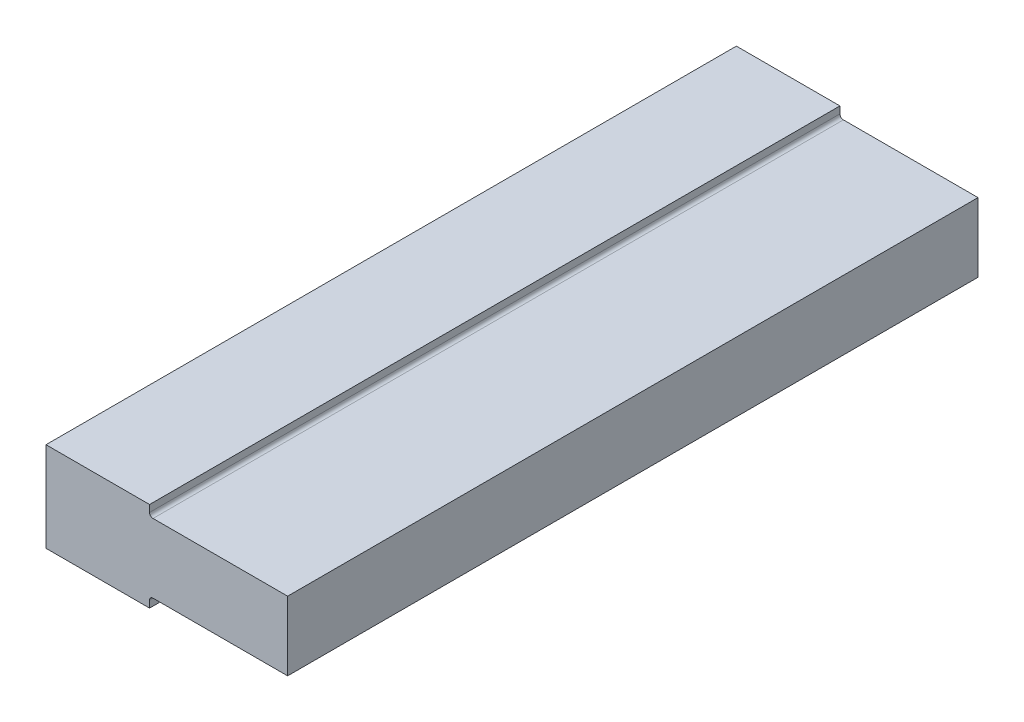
from build123d import *

# Parameters (mm, degrees)
BOSS_EXTRUDE1_DEPTH = 100


with BuildPart() as part:
    # Sketch2 → Boss-Extrude1 (new body)
    with BuildSketch(Plane.XY):
        with BuildLine():
            Line((0, -6.5), (0, 6.5))
            Line((0, 6.5), (15, 6.5))
            Line((15, 6.5), (15, 5.5))
            ThreePointArc((15, 5.5), (15.146446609, 5.146446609), (15.5, 5))
            Line((15.5, 5), (35, 5))
            Line((35, 5), (35, -5))
            Line((35, -5), (15.5, -5))
            ThreePointArc((15.5, -5), (15.146446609, -5.146446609), (15, -5.5))
            Line((15, -5.5), (15, -6.5))
            Line((15, -6.5), (0, -6.5))
        make_face()
    extrude(amount=BOSS_EXTRUDE1_DEPTH)


solid = part.part
